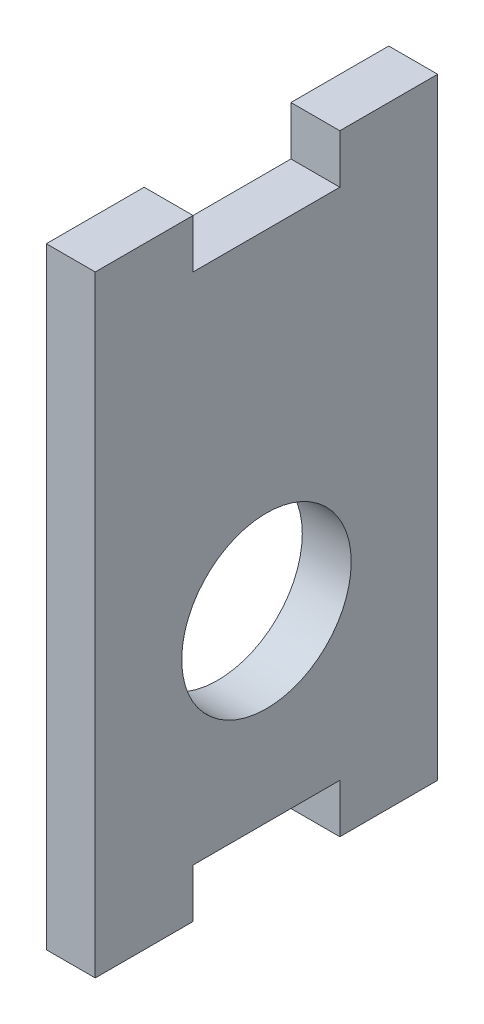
ISO-10303-21;
HEADER;
FILE_DESCRIPTION(('STEP AP214'),'2;1');
FILE_NAME('part.step','',(''),(''),'','','');
FILE_SCHEMA(('AUTOMOTIVE_DESIGN { 1 0 10303 214 1 1 1 1 }'));
ENDSEC;
DATA;
#1=APPLICATION_CONTEXT('core data for automotive mechanical design processes');
#2=APPLICATION_PROTOCOL_DEFINITION('international standard','automotive_design',2000,#1);
#3=PRODUCT_CONTEXT('',#1,'mechanical');
#4=PRODUCT('Part','Part','',(#3));
#5=PRODUCT_RELATED_PRODUCT_CATEGORY('part','',(#4));
#6=PRODUCT_DEFINITION_FORMATION('','',#4);
#7=PRODUCT_DEFINITION_CONTEXT('part definition',#1,'design');
#8=PRODUCT_DEFINITION('design','',#6,#7);
#9=PRODUCT_DEFINITION_SHAPE('','',#8);
#10=(LENGTH_UNIT() NAMED_UNIT(*) SI_UNIT(.MILLI.,.METRE.));
#11=(NAMED_UNIT(*) PLANE_ANGLE_UNIT() SI_UNIT($,.RADIAN.));
#12=(NAMED_UNIT(*) SI_UNIT($,.STERADIAN.) SOLID_ANGLE_UNIT());
#13=UNCERTAINTY_MEASURE_WITH_UNIT(LENGTH_MEASURE(1.E-05),#10,'distance_accuracy_value','');
#14=(GEOMETRIC_REPRESENTATION_CONTEXT(3) GLOBAL_UNCERTAINTY_ASSIGNED_CONTEXT((#13)) GLOBAL_UNIT_ASSIGNED_CONTEXT((#10,
#11,#12)) REPRESENTATION_CONTEXT('',''));
#15=CARTESIAN_POINT('',(0.,0.,0.));
#16=DIRECTION('',(0.,0.,1.));
#17=DIRECTION('',(1.,0.,0.));
#18=AXIS2_PLACEMENT_3D('',#15,#16,#17);
#19=CARTESIAN_POINT('',(6.35,-6.35,22.225));
#20=DIRECTION('',(-1.,0.,0.));
#21=DIRECTION('',(0.,0.,1.));
#22=AXIS2_PLACEMENT_3D('',#19,#20,#21);
#23=PLANE('',#22);
#24=DIRECTION('',(0.,-1.,0.));
#25=VECTOR('',#24,1.);
#26=CARTESIAN_POINT('',(6.35,73.025,22.225));
#27=LINE('',#26,#25);
#28=CARTESIAN_POINT('',(6.35,73.025,22.225));
#29=VERTEX_POINT('',#28);
#30=CARTESIAN_POINT('',(6.35,-6.35,22.225));
#31=VERTEX_POINT('',#30);
#32=EDGE_CURVE('E175',#29,#31,#27,.T.);
#33=ORIENTED_EDGE('',*,*,#32,.T.);
#34=DIRECTION('',(0.,0.,-1.));
#35=VECTOR('',#34,1.);
#36=CARTESIAN_POINT('',(6.35,-6.35,9.525));
#37=LINE('',#36,#35);
#38=CARTESIAN_POINT('',(6.35,-6.35,9.525));
#39=VERTEX_POINT('',#38);
#40=EDGE_CURVE('E103',#31,#39,#37,.T.);
#41=ORIENTED_EDGE('',*,*,#40,.T.);
#42=DIRECTION('',(0.,1.,0.));
#43=VECTOR('',#42,1.);
#44=CARTESIAN_POINT('',(6.35,0.,9.525));
#45=LINE('',#44,#43);
#46=CARTESIAN_POINT('',(6.35,0.,9.525));
#47=VERTEX_POINT('',#46);
#48=EDGE_CURVE('E202',#39,#47,#45,.T.);
#49=ORIENTED_EDGE('',*,*,#48,.T.);
#50=DIRECTION('',(0.,0.,-1.));
#51=VECTOR('',#50,1.);
#52=CARTESIAN_POINT('',(6.35,0.,9.525));
#53=LINE('',#52,#51);
#54=CARTESIAN_POINT('',(6.35,0.,-9.525));
#55=VERTEX_POINT('',#54);
#56=EDGE_CURVE('E221',#47,#55,#53,.T.);
#57=ORIENTED_EDGE('',*,*,#56,.T.);
#58=DIRECTION('',(0.,-1.,0.));
#59=VECTOR('',#58,1.);
#60=CARTESIAN_POINT('',(6.35,0.,-9.525));
#61=LINE('',#60,#59);
#62=CARTESIAN_POINT('',(6.35,-6.35,-9.525));
#63=VERTEX_POINT('',#62);
#64=EDGE_CURVE('E218',#55,#63,#61,.T.);
#65=ORIENTED_EDGE('',*,*,#64,.T.);
#66=DIRECTION('',(0.,0.,-1.));
#67=VECTOR('',#66,1.);
#68=CARTESIAN_POINT('',(6.35,-6.35,-9.525));
#69=LINE('',#68,#67);
#70=CARTESIAN_POINT('',(6.35,-6.35,-22.225));
#71=VERTEX_POINT('',#70);
#72=EDGE_CURVE('E220',#63,#71,#69,.T.);
#73=ORIENTED_EDGE('',*,*,#72,.T.);
#74=DIRECTION('',(0.,1.,0.));
#75=VECTOR('',#74,1.);
#76=CARTESIAN_POINT('',(6.35,73.025,-22.225));
#77=LINE('',#76,#75);
#78=CARTESIAN_POINT('',(6.35,73.025,-22.225));
#79=VERTEX_POINT('',#78);
#80=EDGE_CURVE('E223',#71,#79,#77,.T.);
#81=ORIENTED_EDGE('',*,*,#80,.T.);
#82=DIRECTION('',(0.,0.,1.));
#83=VECTOR('',#82,1.);
#84=CARTESIAN_POINT('',(6.35,73.025,-22.225));
#85=LINE('',#84,#83);
#86=CARTESIAN_POINT('',(6.35,73.025,-9.52500000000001));
#87=VERTEX_POINT('',#86);
#88=EDGE_CURVE('E229',#79,#87,#85,.T.);
#89=ORIENTED_EDGE('',*,*,#88,.T.);
#90=DIRECTION('',(0.,-1.,0.));
#91=VECTOR('',#90,1.);
#92=CARTESIAN_POINT('',(6.35,73.025,-9.52500000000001));
#93=LINE('',#92,#91);
#94=CARTESIAN_POINT('',(6.35,66.675,-9.52500000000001));
#95=VERTEX_POINT('',#94);
#96=EDGE_CURVE('E134',#87,#95,#93,.T.);
#97=ORIENTED_EDGE('',*,*,#96,.T.);
#98=DIRECTION('',(0.,0.,1.));
#99=VECTOR('',#98,1.);
#100=CARTESIAN_POINT('',(6.35,66.675,9.52500000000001));
#101=LINE('',#100,#99);
#102=CARTESIAN_POINT('',(6.35,66.675,9.52500000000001));
#103=VERTEX_POINT('',#102);
#104=EDGE_CURVE('E128',#95,#103,#101,.T.);
#105=ORIENTED_EDGE('',*,*,#104,.T.);
#106=DIRECTION('',(0.,1.,0.));
#107=VECTOR('',#106,1.);
#108=CARTESIAN_POINT('',(6.35,73.025,9.52500000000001));
#109=LINE('',#108,#107);
#110=CARTESIAN_POINT('',(6.35,73.025,9.52500000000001));
#111=VERTEX_POINT('',#110);
#112=EDGE_CURVE('E132',#103,#111,#109,.T.);
#113=ORIENTED_EDGE('',*,*,#112,.T.);
#114=DIRECTION('',(0.,0.,1.));
#115=VECTOR('',#114,1.);
#116=CARTESIAN_POINT('',(6.35,73.025,22.225));
#117=LINE('',#116,#115);
#118=EDGE_CURVE('E48',#111,#29,#117,.T.);
#119=ORIENTED_EDGE('',*,*,#118,.T.);
#120=EDGE_LOOP('',(#33,#41,#49,#57,#65,#73,#81,#89,#97,#105,#113,#119));
#121=FACE_BOUND('',#120,.T.);
#122=CARTESIAN_POINT('',(6.35,23.8125,0.));
#123=DIRECTION('',(1.,0.,0.));
#124=DIRECTION('',(0.,0.,-1.));
#125=AXIS2_PLACEMENT_3D('',#122,#123,#124);
#126=CIRCLE('',#125,11.);
#127=CARTESIAN_POINT('',(6.35,23.8125,-11.));
#128=VERTEX_POINT('',#127);
#129=EDGE_CURVE('E156',#128,#128,#126,.T.);
#130=ORIENTED_EDGE('',*,*,#129,.F.);
#131=EDGE_LOOP('',(#130));
#132=FACE_BOUND('',#131,.T.);
#133=ADVANCED_FACE('F31',(#121,#132),#23,.F.);
#134=CARTESIAN_POINT('',(0.,-6.35,22.225));
#135=DIRECTION('',(-1.,0.,0.));
#136=DIRECTION('',(0.,0.,1.));
#137=AXIS2_PLACEMENT_3D('',#134,#135,#136);
#138=PLANE('',#137);
#139=DIRECTION('',(0.,-1.,0.));
#140=VECTOR('',#139,1.);
#141=CARTESIAN_POINT('',(0.,73.025,22.225));
#142=LINE('',#141,#140);
#143=CARTESIAN_POINT('',(0.,73.025,22.225));
#144=VERTEX_POINT('',#143);
#145=CARTESIAN_POINT('',(0.,-6.35,22.225));
#146=VERTEX_POINT('',#145);
#147=EDGE_CURVE('E152',#144,#146,#142,.T.);
#148=ORIENTED_EDGE('',*,*,#147,.F.);
#149=DIRECTION('',(0.,0.,1.));
#150=VECTOR('',#149,1.);
#151=CARTESIAN_POINT('',(0.,73.025,22.225));
#152=LINE('',#151,#150);
#153=CARTESIAN_POINT('',(0.,73.025,9.52500000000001));
#154=VERTEX_POINT('',#153);
#155=EDGE_CURVE('E95',#154,#144,#152,.T.);
#156=ORIENTED_EDGE('',*,*,#155,.F.);
#157=DIRECTION('',(0.,1.,0.));
#158=VECTOR('',#157,1.);
#159=CARTESIAN_POINT('',(0.,73.025,9.52500000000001));
#160=LINE('',#159,#158);
#161=CARTESIAN_POINT('',(0.,66.675,9.52500000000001));
#162=VERTEX_POINT('',#161);
#163=EDGE_CURVE('E89',#162,#154,#160,.T.);
#164=ORIENTED_EDGE('',*,*,#163,.F.);
#165=DIRECTION('',(0.,0.,1.));
#166=VECTOR('',#165,1.);
#167=CARTESIAN_POINT('',(0.,66.675,9.52500000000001));
#168=LINE('',#167,#166);
#169=CARTESIAN_POINT('',(0.,66.675,-9.52500000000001));
#170=VERTEX_POINT('',#169);
#171=EDGE_CURVE('E142',#170,#162,#168,.T.);
#172=ORIENTED_EDGE('',*,*,#171,.F.);
#173=DIRECTION('',(0.,-1.,0.));
#174=VECTOR('',#173,1.);
#175=CARTESIAN_POINT('',(0.,73.025,-9.52500000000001));
#176=LINE('',#175,#174);
#177=CARTESIAN_POINT('',(0.,73.025,-9.52500000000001));
#178=VERTEX_POINT('',#177);
#179=EDGE_CURVE('E170',#178,#170,#176,.T.);
#180=ORIENTED_EDGE('',*,*,#179,.F.);
#181=DIRECTION('',(0.,0.,1.));
#182=VECTOR('',#181,1.);
#183=CARTESIAN_POINT('',(0.,73.025,-22.225));
#184=LINE('',#183,#182);
#185=CARTESIAN_POINT('',(0.,73.025,-22.225));
#186=VERTEX_POINT('',#185);
#187=EDGE_CURVE('E168',#186,#178,#184,.T.);
#188=ORIENTED_EDGE('',*,*,#187,.F.);
#189=DIRECTION('',(0.,1.,0.));
#190=VECTOR('',#189,1.);
#191=CARTESIAN_POINT('',(0.,73.025,-22.225));
#192=LINE('',#191,#190);
#193=CARTESIAN_POINT('',(0.,-6.35,-22.225));
#194=VERTEX_POINT('',#193);
#195=EDGE_CURVE('E166',#194,#186,#192,.T.);
#196=ORIENTED_EDGE('',*,*,#195,.F.);
#197=DIRECTION('',(0.,0.,-1.));
#198=VECTOR('',#197,1.);
#199=CARTESIAN_POINT('',(0.,-6.35,-9.525));
#200=LINE('',#199,#198);
#201=CARTESIAN_POINT('',(0.,-6.35,-9.525));
#202=VERTEX_POINT('',#201);
#203=EDGE_CURVE('E164',#202,#194,#200,.T.);
#204=ORIENTED_EDGE('',*,*,#203,.F.);
#205=DIRECTION('',(0.,-1.,0.));
#206=VECTOR('',#205,1.);
#207=CARTESIAN_POINT('',(0.,0.,-9.525));
#208=LINE('',#207,#206);
#209=CARTESIAN_POINT('',(0.,0.,-9.525));
#210=VERTEX_POINT('',#209);
#211=EDGE_CURVE('E162',#210,#202,#208,.T.);
#212=ORIENTED_EDGE('',*,*,#211,.F.);
#213=DIRECTION('',(0.,0.,-1.));
#214=VECTOR('',#213,1.);
#215=CARTESIAN_POINT('',(0.,0.,9.525));
#216=LINE('',#215,#214);
#217=CARTESIAN_POINT('',(0.,0.,9.525));
#218=VERTEX_POINT('',#217);
#219=EDGE_CURVE('E160',#218,#210,#216,.T.);
#220=ORIENTED_EDGE('',*,*,#219,.F.);
#221=DIRECTION('',(0.,1.,0.));
#222=VECTOR('',#221,1.);
#223=CARTESIAN_POINT('',(0.,0.,9.525));
#224=LINE('',#223,#222);
#225=CARTESIAN_POINT('',(0.,-6.35,9.525));
#226=VERTEX_POINT('',#225);
#227=EDGE_CURVE('E158',#226,#218,#224,.T.);
#228=ORIENTED_EDGE('',*,*,#227,.F.);
#229=DIRECTION('',(0.,0.,-1.));
#230=VECTOR('',#229,1.);
#231=CARTESIAN_POINT('',(0.,-6.35,9.525));
#232=LINE('',#231,#230);
#233=EDGE_CURVE('E155',#146,#226,#232,.T.);
#234=ORIENTED_EDGE('',*,*,#233,.F.);
#235=EDGE_LOOP('',(#148,#156,#164,#172,#180,#188,#196,#204,#212,#220,#228,#234));
#236=FACE_BOUND('',#235,.T.);
#237=CARTESIAN_POINT('',(0.,23.8125,0.));
#238=DIRECTION('',(1.,0.,0.));
#239=DIRECTION('',(0.,0.,-1.));
#240=AXIS2_PLACEMENT_3D('',#237,#238,#239);
#241=CIRCLE('',#240,11.);
#242=CARTESIAN_POINT('',(0.,23.8125,-11.));
#243=VERTEX_POINT('',#242);
#244=EDGE_CURVE('E376',#243,#243,#241,.T.);
#245=ORIENTED_EDGE('',*,*,#244,.T.);
#246=EDGE_LOOP('',(#245));
#247=FACE_BOUND('',#246,.T.);
#248=ADVANCED_FACE('F206',(#236,#247),#138,.T.);
#249=CARTESIAN_POINT('',(6.35,73.025,22.225));
#250=DIRECTION('',(0.,0.,-1.));
#251=DIRECTION('',(0.,1.,0.));
#252=AXIS2_PLACEMENT_3D('',#249,#250,#251);
#253=PLANE('',#252);
#254=ORIENTED_EDGE('',*,*,#147,.T.);
#255=DIRECTION('',(-1.,0.,0.));
#256=VECTOR('',#255,1.);
#257=CARTESIAN_POINT('',(6.35,-6.35,22.225));
#258=LINE('',#257,#256);
#259=EDGE_CURVE('E11',#31,#146,#258,.T.);
#260=ORIENTED_EDGE('',*,*,#259,.F.);
#261=ORIENTED_EDGE('',*,*,#32,.F.);
#262=DIRECTION('',(-1.,0.,0.));
#263=VECTOR('',#262,1.);
#264=CARTESIAN_POINT('',(6.35,73.025,22.225));
#265=LINE('',#264,#263);
#266=EDGE_CURVE('E148',#29,#144,#265,.T.);
#267=ORIENTED_EDGE('',*,*,#266,.T.);
#268=EDGE_LOOP('',(#254,#260,#261,#267));
#269=FACE_BOUND('',#268,.T.);
#270=ADVANCED_FACE('F33',(#269),#253,.F.);
#271=CARTESIAN_POINT('',(6.35,-6.35,9.525));
#272=DIRECTION('',(0.,1.,0.));
#273=DIRECTION('',(0.,0.,1.));
#274=AXIS2_PLACEMENT_3D('',#271,#272,#273);
#275=PLANE('',#274);
#276=ORIENTED_EDGE('',*,*,#233,.T.);
#277=DIRECTION('',(-1.,0.,0.));
#278=VECTOR('',#277,1.);
#279=CARTESIAN_POINT('',(6.35,-6.35,9.525));
#280=LINE('',#279,#278);
#281=EDGE_CURVE('E40',#39,#226,#280,.T.);
#282=ORIENTED_EDGE('',*,*,#281,.F.);
#283=ORIENTED_EDGE('',*,*,#40,.F.);
#284=ORIENTED_EDGE('',*,*,#259,.T.);
#285=EDGE_LOOP('',(#276,#282,#283,#284));
#286=FACE_BOUND('',#285,.T.);
#287=ADVANCED_FACE('F263',(#286),#275,.F.);
#288=CARTESIAN_POINT('',(6.35,0.,9.525));
#289=DIRECTION('',(0.,0.,1.));
#290=DIRECTION('',(1.,0.,0.));
#291=AXIS2_PLACEMENT_3D('',#288,#289,#290);
#292=PLANE('',#291);
#293=ORIENTED_EDGE('',*,*,#227,.T.);
#294=DIRECTION('',(-1.,0.,0.));
#295=VECTOR('',#294,1.);
#296=CARTESIAN_POINT('',(6.35,0.,9.525));
#297=LINE('',#296,#295);
#298=EDGE_CURVE('E194',#47,#218,#297,.T.);
#299=ORIENTED_EDGE('',*,*,#298,.F.);
#300=ORIENTED_EDGE('',*,*,#48,.F.);
#301=ORIENTED_EDGE('',*,*,#281,.T.);
#302=EDGE_LOOP('',(#293,#299,#300,#301));
#303=FACE_BOUND('',#302,.T.);
#304=ADVANCED_FACE('F200',(#303),#292,.F.);
#305=CARTESIAN_POINT('',(6.35,0.,9.525));
#306=DIRECTION('',(0.,1.,0.));
#307=DIRECTION('',(0.,0.,1.));
#308=AXIS2_PLACEMENT_3D('',#305,#306,#307);
#309=PLANE('',#308);
#310=ORIENTED_EDGE('',*,*,#219,.T.);
#311=DIRECTION('',(-1.,0.,0.));
#312=VECTOR('',#311,1.);
#313=CARTESIAN_POINT('',(6.35,0.,-9.525));
#314=LINE('',#313,#312);
#315=EDGE_CURVE('E191',#55,#210,#314,.T.);
#316=ORIENTED_EDGE('',*,*,#315,.F.);
#317=ORIENTED_EDGE('',*,*,#56,.F.);
#318=ORIENTED_EDGE('',*,*,#298,.T.);
#319=EDGE_LOOP('',(#310,#316,#317,#318));
#320=FACE_BOUND('',#319,.T.);
#321=ADVANCED_FACE('F212',(#320),#309,.F.);
#322=CARTESIAN_POINT('',(6.35,0.,-9.525));
#323=DIRECTION('',(0.,0.,-1.));
#324=DIRECTION('',(-1.,0.,0.));
#325=AXIS2_PLACEMENT_3D('',#322,#323,#324);
#326=PLANE('',#325);
#327=ORIENTED_EDGE('',*,*,#211,.T.);
#328=DIRECTION('',(-1.,0.,0.));
#329=VECTOR('',#328,1.);
#330=CARTESIAN_POINT('',(6.35,-6.35,-9.525));
#331=LINE('',#330,#329);
#332=EDGE_CURVE('E188',#63,#202,#331,.T.);
#333=ORIENTED_EDGE('',*,*,#332,.F.);
#334=ORIENTED_EDGE('',*,*,#64,.F.);
#335=ORIENTED_EDGE('',*,*,#315,.T.);
#336=EDGE_LOOP('',(#327,#333,#334,#335));
#337=FACE_BOUND('',#336,.T.);
#338=ADVANCED_FACE('F216',(#337),#326,.F.);
#339=CARTESIAN_POINT('',(6.35,-6.35,-9.525));
#340=DIRECTION('',(0.,1.,0.));
#341=DIRECTION('',(0.,0.,1.));
#342=AXIS2_PLACEMENT_3D('',#339,#340,#341);
#343=PLANE('',#342);
#344=ORIENTED_EDGE('',*,*,#203,.T.);
#345=DIRECTION('',(-1.,0.,0.));
#346=VECTOR('',#345,1.);
#347=CARTESIAN_POINT('',(6.35,-6.35,-22.225));
#348=LINE('',#347,#346);
#349=EDGE_CURVE('E185',#71,#194,#348,.T.);
#350=ORIENTED_EDGE('',*,*,#349,.F.);
#351=ORIENTED_EDGE('',*,*,#72,.F.);
#352=ORIENTED_EDGE('',*,*,#332,.T.);
#353=EDGE_LOOP('',(#344,#350,#351,#352));
#354=FACE_BOUND('',#353,.T.);
#355=ADVANCED_FACE('F276',(#354),#343,.F.);
#356=CARTESIAN_POINT('',(6.35,73.025,-22.225));
#357=DIRECTION('',(0.,0.,1.));
#358=DIRECTION('',(0.,-1.,0.));
#359=AXIS2_PLACEMENT_3D('',#356,#357,#358);
#360=PLANE('',#359);
#361=ORIENTED_EDGE('',*,*,#195,.T.);
#362=DIRECTION('',(-1.,0.,0.));
#363=VECTOR('',#362,1.);
#364=CARTESIAN_POINT('',(6.35,73.025,-22.225));
#365=LINE('',#364,#363);
#366=EDGE_CURVE('E182',#79,#186,#365,.T.);
#367=ORIENTED_EDGE('',*,*,#366,.F.);
#368=ORIENTED_EDGE('',*,*,#80,.F.);
#369=ORIENTED_EDGE('',*,*,#349,.T.);
#370=EDGE_LOOP('',(#361,#367,#368,#369));
#371=FACE_BOUND('',#370,.T.);
#372=ADVANCED_FACE('F279',(#371),#360,.F.);
#373=CARTESIAN_POINT('',(6.35,73.025,-22.225));
#374=DIRECTION('',(0.,-1.,0.));
#375=DIRECTION('',(0.,0.,-1.));
#376=AXIS2_PLACEMENT_3D('',#373,#374,#375);
#377=PLANE('',#376);
#378=ORIENTED_EDGE('',*,*,#187,.T.);
#379=DIRECTION('',(-1.,0.,0.));
#380=VECTOR('',#379,1.);
#381=CARTESIAN_POINT('',(6.35,73.025,-9.52500000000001));
#382=LINE('',#381,#380);
#383=EDGE_CURVE('E179',#87,#178,#382,.T.);
#384=ORIENTED_EDGE('',*,*,#383,.F.);
#385=ORIENTED_EDGE('',*,*,#88,.F.);
#386=ORIENTED_EDGE('',*,*,#366,.T.);
#387=EDGE_LOOP('',(#378,#384,#385,#386));
#388=FACE_BOUND('',#387,.T.);
#389=ADVANCED_FACE('F235',(#388),#377,.F.);
#390=CARTESIAN_POINT('',(6.35,73.025,-9.52500000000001));
#391=DIRECTION('',(0.,0.,-1.));
#392=DIRECTION('',(-1.,0.,0.));
#393=AXIS2_PLACEMENT_3D('',#390,#391,#392);
#394=PLANE('',#393);
#395=ORIENTED_EDGE('',*,*,#179,.T.);
#396=DIRECTION('',(-1.,0.,0.));
#397=VECTOR('',#396,1.);
#398=CARTESIAN_POINT('',(6.35,66.675,-9.52500000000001));
#399=LINE('',#398,#397);
#400=EDGE_CURVE('E143',#95,#170,#399,.T.);
#401=ORIENTED_EDGE('',*,*,#400,.F.);
#402=ORIENTED_EDGE('',*,*,#96,.F.);
#403=ORIENTED_EDGE('',*,*,#383,.T.);
#404=EDGE_LOOP('',(#395,#401,#402,#403));
#405=FACE_BOUND('',#404,.T.);
#406=ADVANCED_FACE('F239',(#405),#394,.F.);
#407=CARTESIAN_POINT('',(6.35,66.675,9.52500000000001));
#408=DIRECTION('',(0.,-1.,0.));
#409=DIRECTION('',(0.,0.,-1.));
#410=AXIS2_PLACEMENT_3D('',#407,#408,#409);
#411=PLANE('',#410);
#412=ORIENTED_EDGE('',*,*,#171,.T.);
#413=DIRECTION('',(-1.,0.,0.));
#414=VECTOR('',#413,1.);
#415=CARTESIAN_POINT('',(6.35,66.675,9.52500000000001));
#416=LINE('',#415,#414);
#417=EDGE_CURVE('E139',#103,#162,#416,.T.);
#418=ORIENTED_EDGE('',*,*,#417,.F.);
#419=ORIENTED_EDGE('',*,*,#104,.F.);
#420=ORIENTED_EDGE('',*,*,#400,.T.);
#421=EDGE_LOOP('',(#412,#418,#419,#420));
#422=FACE_BOUND('',#421,.T.);
#423=ADVANCED_FACE('F140',(#422),#411,.F.);
#424=CARTESIAN_POINT('',(6.35,73.025,9.52500000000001));
#425=DIRECTION('',(0.,0.,1.));
#426=DIRECTION('',(1.,0.,0.));
#427=AXIS2_PLACEMENT_3D('',#424,#425,#426);
#428=PLANE('',#427);
#429=ORIENTED_EDGE('',*,*,#163,.T.);
#430=DIRECTION('',(-1.,0.,0.));
#431=VECTOR('',#430,1.);
#432=CARTESIAN_POINT('',(6.35,73.025,9.52500000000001));
#433=LINE('',#432,#431);
#434=EDGE_CURVE('E144',#111,#154,#433,.T.);
#435=ORIENTED_EDGE('',*,*,#434,.F.);
#436=ORIENTED_EDGE('',*,*,#112,.F.);
#437=ORIENTED_EDGE('',*,*,#417,.T.);
#438=EDGE_LOOP('',(#429,#435,#436,#437));
#439=FACE_BOUND('',#438,.T.);
#440=ADVANCED_FACE('F146',(#439),#428,.F.);
#441=CARTESIAN_POINT('',(6.35,73.025,22.225));
#442=DIRECTION('',(0.,-1.,0.));
#443=DIRECTION('',(0.,0.,-1.));
#444=AXIS2_PLACEMENT_3D('',#441,#442,#443);
#445=PLANE('',#444);
#446=ORIENTED_EDGE('',*,*,#155,.T.);
#447=ORIENTED_EDGE('',*,*,#266,.F.);
#448=ORIENTED_EDGE('',*,*,#118,.F.);
#449=ORIENTED_EDGE('',*,*,#434,.T.);
#450=EDGE_LOOP('',(#446,#447,#448,#449));
#451=FACE_BOUND('',#450,.T.);
#452=ADVANCED_FACE('F243',(#451),#445,.F.);
#453=CARTESIAN_POINT('',(6.35,23.8125,0.));
#454=DIRECTION('',(-1.,0.,0.));
#455=DIRECTION('',(0.,0.,1.));
#456=AXIS2_PLACEMENT_3D('',#453,#454,#455);
#457=CYLINDRICAL_SURFACE('',#456,11.);
#458=ORIENTED_EDGE('',*,*,#129,.T.);
#459=EDGE_LOOP('',(#458));
#460=FACE_BOUND('',#459,.T.);
#461=ORIENTED_EDGE('',*,*,#244,.F.);
#462=EDGE_LOOP('',(#461));
#463=FACE_BOUND('',#462,.T.);
#464=ADVANCED_FACE('F245',(#460,#463),#457,.F.);
#465=CLOSED_SHELL('',(#133,#248,#270,#287,#304,#321,#338,#355,#372,#389,#406,#423,#440,#452,#464));
#466=MANIFOLD_SOLID_BREP('B2',#465);
#467=ADVANCED_BREP_SHAPE_REPRESENTATION('',(#18,#466),#14);
#468=SHAPE_DEFINITION_REPRESENTATION(#9,#467);
ENDSEC;
END-ISO-10303-21;
